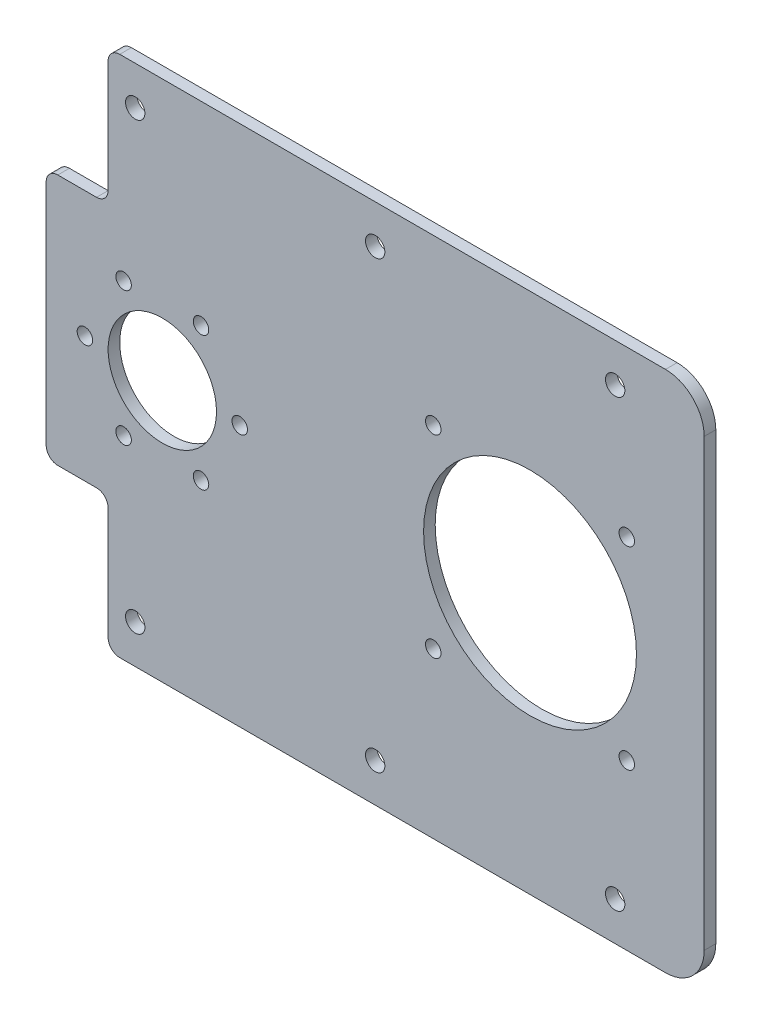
from build123d import *

# Parameters (mm, degrees)
SKETCH_1_W               = 170
SKETCH_1_H               = 135
SKETCH_1_R               = 14
EXTRUDE_1_DEPTH          = 1.5
CUT_EXTRUDE_1_DEPTH      = 109.551830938
CUT_EXTRUDE_1_DEPTH_BACK = 109.551830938
SKETCH_2_R               = 27.5
MM_1_D                   = 4
MM_1_DEPTH               = 6.5
MM_1_TIP                 = 1.201721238
SKETCH_5_R               = 2.5
SKETCH_5_R_2             = 2
CUT_EXTRUDE_2_DEPTH      = 109.582917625
FILLET_1_R               = 10
SKETCH_6_W               = 16
SKETCH_6_H               = 35
CUT_EXTRUDE_3_DEPTH      = 10
FILLET_2_R               = 3


with BuildPart() as part:
    # Sketch 1 → Extrude 1 (new, symmetric)
    with BuildSketch(Plane.XY):
        Rectangle(SKETCH_1_W, SKETCH_1_H)
        with Locations((-55, 0)):
            Circle(SKETCH_1_R, mode=Mode.SUBTRACT)
    extrude(amount=EXTRUDE_1_DEPTH, both=True)

    # Sketch 2 → Cut-Extrude 1 (cut, two sides: drawn at the far end of the back side and taken through both)
    with BuildSketch(Plane.XY.offset(-CUT_EXTRUDE_1_DEPTH_BACK)):
        with Locations((40, 0)):
            Circle(SKETCH_2_R)
    extrude(amount=CUT_EXTRUDE_1_DEPTH + CUT_EXTRUDE_1_DEPTH_BACK, mode=Mode.SUBTRACT)

    # mm _1
    with Locations(Plane(origin=(15, 25, 1.5), x_dir=(1, 0, 0), z_dir=(0, 0, 1))):
        with Locations((0, 0), (50, 0), (0, -50), (50, -50)):
            Hole(MM_1_D / 2, depth=MM_1_DEPTH)
            with Locations((0, 0, -(MM_1_DEPTH + MM_1_TIP / 2))):  # 118° drill point
                Cone(0, MM_1_D / 2, MM_1_TIP, mode=Mode.SUBTRACT)

    # Sketch 5 → Cut-Extrude 2 (cut, through all)
    with BuildSketch(Plane.XY.offset(1.5)):
        with Locations((62, 57.5)):
            Circle(SKETCH_5_R)
        with Locations((0, 57.5)):
            Circle(SKETCH_5_R)
        with Locations((-62, 57.5)):
            Circle(SKETCH_5_R)
        with Locations(Location((-62, -57.5, 0), (0, 0, 180))):
            Circle(SKETCH_5_R)
        with Locations(Location((0, -57.5, 0), (0, 0, 180))):
            Circle(SKETCH_5_R)
        with Locations(Location((62, -57.5, 0), (0, 0, 180))):
            Circle(SKETCH_5_R)
        with Locations((-75, 0)):
            Circle(SKETCH_5_R_2)
        with Locations((-35, 0)):
            Circle(SKETCH_5_R_2)
        with Locations((-65, -17.320508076)):
            Circle(SKETCH_5_R_2)
        with Locations((-45, 17.320508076)):
            Circle(SKETCH_5_R_2)
        with Locations((-45, -17.320508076)):
            Circle(SKETCH_5_R_2)
        with Locations((-65, 17.320508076)):
            Circle(SKETCH_5_R_2)
    extrude(amount=-CUT_EXTRUDE_2_DEPTH, mode=Mode.SUBTRACT)

    # Fillet 1
    fillet_1_edges = [part.edges().sort_by_distance(p)[0] for p in [
        (85, -67.5, 0),
        (85, 67.5, 0),
    ]]
    fillet(fillet_1_edges, radius=FILLET_1_R)

    # Sketch 6 → Cut-Extrude 3 (cut)
    with BuildSketch(Plane.XY.offset(1.5)):
        with Locations((-77, -50)):
            Rectangle(SKETCH_6_W, SKETCH_6_H)
        with Locations((-77, 50)):
            Rectangle(SKETCH_6_W, SKETCH_6_H)
    extrude(amount=-CUT_EXTRUDE_3_DEPTH, mode=Mode.SUBTRACT)

    # Fillet 2
    fillet_2_edges = [part.edges().sort_by_distance(p)[0] for p in [
        (-69, -67.5, 0),
        (-85, -32.5, 0),
        (-69, -32.5, 0),
        (-85, 32.5, 0),
        (-69, 32.5, 0),
        (-69, 67.5, 0),
    ]]
    fillet(fillet_2_edges, radius=FILLET_2_R)


solid = part.part
